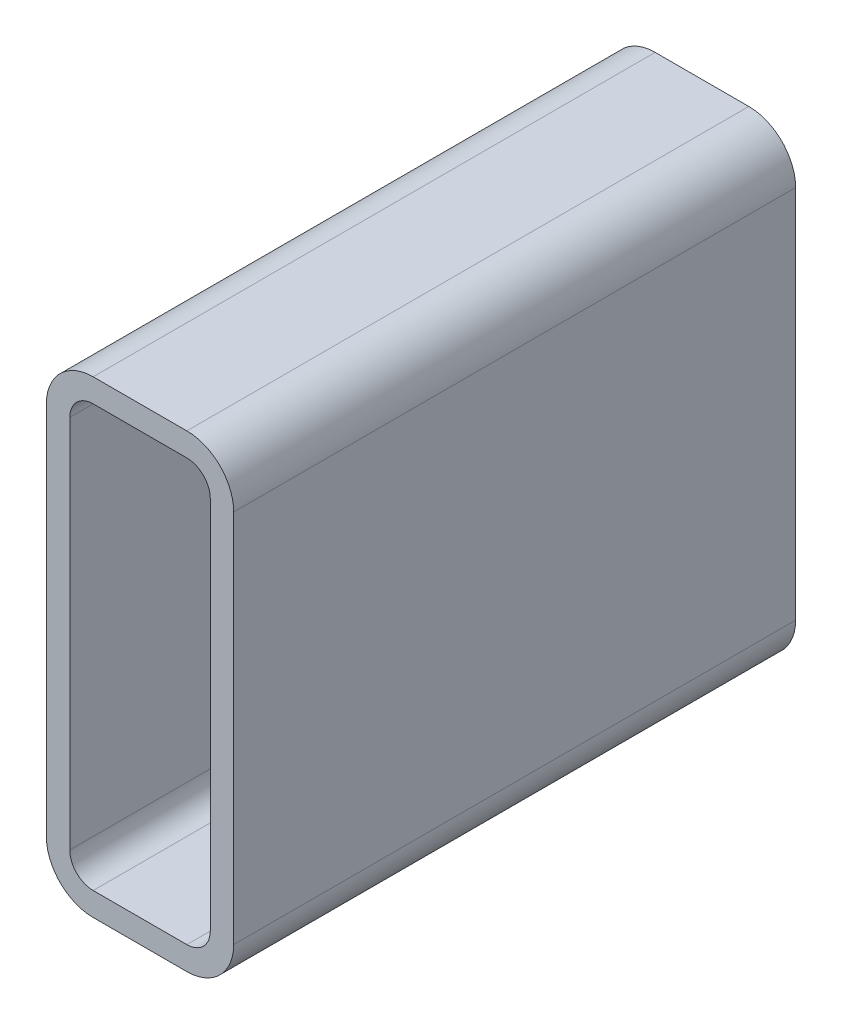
ISO-10303-21;
HEADER;
FILE_DESCRIPTION(('STEP AP214'),'2;1');
FILE_NAME('part.step','',(''),(''),'','','');
FILE_SCHEMA(('AUTOMOTIVE_DESIGN { 1 0 10303 214 1 1 1 1 }'));
ENDSEC;
DATA;
#1=APPLICATION_CONTEXT('core data for automotive mechanical design processes');
#2=APPLICATION_PROTOCOL_DEFINITION('international standard','automotive_design',2000,#1);
#3=PRODUCT_CONTEXT('',#1,'mechanical');
#4=PRODUCT('Part','Part','',(#3));
#5=PRODUCT_RELATED_PRODUCT_CATEGORY('part','',(#4));
#6=PRODUCT_DEFINITION_FORMATION('','',#4);
#7=PRODUCT_DEFINITION_CONTEXT('part definition',#1,'design');
#8=PRODUCT_DEFINITION('design','',#6,#7);
#9=PRODUCT_DEFINITION_SHAPE('','',#8);
#10=(LENGTH_UNIT() NAMED_UNIT(*) SI_UNIT(.MILLI.,.METRE.));
#11=(NAMED_UNIT(*) PLANE_ANGLE_UNIT() SI_UNIT($,.RADIAN.));
#12=(NAMED_UNIT(*) SI_UNIT($,.STERADIAN.) SOLID_ANGLE_UNIT());
#13=UNCERTAINTY_MEASURE_WITH_UNIT(LENGTH_MEASURE(1.E-05),#10,'distance_accuracy_value','');
#14=(GEOMETRIC_REPRESENTATION_CONTEXT(3) GLOBAL_UNCERTAINTY_ASSIGNED_CONTEXT((#13)) GLOBAL_UNIT_ASSIGNED_CONTEXT((#10,
#11,#12)) REPRESENTATION_CONTEXT('',''));
#15=CARTESIAN_POINT('',(0.,0.,0.));
#16=DIRECTION('',(0.,0.,1.));
#17=DIRECTION('',(1.,0.,0.));
#18=AXIS2_PLACEMENT_3D('',#15,#16,#17);
#19=CARTESIAN_POINT('',(27.0751778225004,230.520313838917,304.8));
#20=DIRECTION('',(0.,0.,1.));
#21=DIRECTION('',(1.,0.,0.));
#22=AXIS2_PLACEMENT_3D('',#19,#20,#21);
#23=PLANE('',#22);
#24=CARTESIAN_POINT('',(27.0751778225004,230.520313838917,304.8));
#25=DIRECTION('',(0.,0.,1.));
#26=DIRECTION('',(1.,0.,0.));
#27=AXIS2_PLACEMENT_3D('',#24,#25,#26);
#28=CIRCLE('',#27,25.4);
#29=CARTESIAN_POINT('',(27.0751778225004,255.920313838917,304.8));
#30=VERTEX_POINT('',#29);
#31=CARTESIAN_POINT('',(1.67517782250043,230.520313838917,304.8));
#32=VERTEX_POINT('',#31);
#33=EDGE_CURVE('E211',#30,#32,#28,.T.);
#34=ORIENTED_EDGE('',*,*,#33,.T.);
#35=DIRECTION('',(0.,-1.,0.));
#36=VECTOR('',#35,1.);
#37=CARTESIAN_POINT('',(1.67517782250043,27.3203138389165,304.8));
#38=LINE('',#37,#36);
#39=CARTESIAN_POINT('',(1.67517782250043,27.3203138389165,304.8));
#40=VERTEX_POINT('',#39);
#41=EDGE_CURVE('E214',#32,#40,#38,.T.);
#42=ORIENTED_EDGE('',*,*,#41,.T.);
#43=CARTESIAN_POINT('',(27.0751778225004,27.3203138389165,304.8));
#44=DIRECTION('',(0.,0.,1.));
#45=DIRECTION('',(1.,0.,0.));
#46=AXIS2_PLACEMENT_3D('',#43,#44,#45);
#47=CIRCLE('',#46,25.4);
#48=CARTESIAN_POINT('',(27.0751778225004,1.92031383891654,304.8));
#49=VERTEX_POINT('',#48);
#50=EDGE_CURVE('E217',#40,#49,#47,.T.);
#51=ORIENTED_EDGE('',*,*,#50,.T.);
#52=DIRECTION('',(1.,0.,0.));
#53=VECTOR('',#52,1.);
#54=CARTESIAN_POINT('',(77.8751778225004,1.92031383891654,304.8));
#55=LINE('',#54,#53);
#56=CARTESIAN_POINT('',(77.8751778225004,1.92031383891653,304.8));
#57=VERTEX_POINT('',#56);
#58=EDGE_CURVE('E219',#49,#57,#55,.T.);
#59=ORIENTED_EDGE('',*,*,#58,.T.);
#60=CARTESIAN_POINT('',(77.8751778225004,27.3203138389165,304.8));
#61=DIRECTION('',(0.,0.,1.));
#62=DIRECTION('',(1.,0.,0.));
#63=AXIS2_PLACEMENT_3D('',#60,#61,#62);
#64=CIRCLE('',#63,25.4);
#65=CARTESIAN_POINT('',(103.2751778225,27.3203138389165,304.8));
#66=VERTEX_POINT('',#65);
#67=EDGE_CURVE('E221',#57,#66,#64,.T.);
#68=ORIENTED_EDGE('',*,*,#67,.T.);
#69=DIRECTION('',(0.,1.,0.));
#70=VECTOR('',#69,1.);
#71=CARTESIAN_POINT('',(103.2751778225,230.520313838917,304.8));
#72=LINE('',#71,#70);
#73=CARTESIAN_POINT('',(103.2751778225,230.520313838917,304.8));
#74=VERTEX_POINT('',#73);
#75=EDGE_CURVE('E223',#66,#74,#72,.T.);
#76=ORIENTED_EDGE('',*,*,#75,.T.);
#77=CARTESIAN_POINT('',(77.8751778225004,230.520313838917,304.8));
#78=DIRECTION('',(0.,0.,1.));
#79=DIRECTION('',(1.,0.,0.));
#80=AXIS2_PLACEMENT_3D('',#77,#78,#79);
#81=CIRCLE('',#80,25.4);
#82=CARTESIAN_POINT('',(77.8751778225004,255.920313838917,304.8));
#83=VERTEX_POINT('',#82);
#84=EDGE_CURVE('E225',#74,#83,#81,.T.);
#85=ORIENTED_EDGE('',*,*,#84,.T.);
#86=DIRECTION('',(-1.,0.,0.));
#87=VECTOR('',#86,1.);
#88=CARTESIAN_POINT('',(27.0751778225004,255.920313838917,304.8));
#89=LINE('',#88,#87);
#90=EDGE_CURVE('E227',#83,#30,#89,.T.);
#91=ORIENTED_EDGE('',*,*,#90,.T.);
#92=EDGE_LOOP('',(#34,#42,#51,#59,#68,#76,#85,#91));
#93=FACE_BOUND('',#92,.T.);
#94=DIRECTION('',(0.,-1.,0.));
#95=VECTOR('',#94,1.);
#96=CARTESIAN_POINT('',(14.3751778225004,27.3203138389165,304.8));
#97=LINE('',#96,#95);
#98=CARTESIAN_POINT('',(14.3751778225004,230.520313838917,304.8));
#99=VERTEX_POINT('',#98);
#100=CARTESIAN_POINT('',(14.3751778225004,27.3203138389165,304.8));
#101=VERTEX_POINT('',#100);
#102=EDGE_CURVE('E154',#99,#101,#97,.T.);
#103=ORIENTED_EDGE('',*,*,#102,.F.);
#104=CARTESIAN_POINT('',(27.0751778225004,230.520313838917,304.8));
#105=DIRECTION('',(0.,0.,1.));
#106=DIRECTION('',(1.,0.,0.));
#107=AXIS2_PLACEMENT_3D('',#104,#105,#106);
#108=CIRCLE('',#107,12.7);
#109=CARTESIAN_POINT('',(27.0751778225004,243.220313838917,304.8));
#110=VERTEX_POINT('',#109);
#111=EDGE_CURVE('E146',#110,#99,#108,.T.);
#112=ORIENTED_EDGE('',*,*,#111,.F.);
#113=DIRECTION('',(-1.,0.,0.));
#114=VECTOR('',#113,1.);
#115=CARTESIAN_POINT('',(27.0751778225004,243.220313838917,304.8));
#116=LINE('',#115,#114);
#117=CARTESIAN_POINT('',(77.8751778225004,243.220313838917,304.8));
#118=VERTEX_POINT('',#117);
#119=EDGE_CURVE('E179',#118,#110,#116,.T.);
#120=ORIENTED_EDGE('',*,*,#119,.F.);
#121=CARTESIAN_POINT('',(77.8751778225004,230.520313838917,304.8));
#122=DIRECTION('',(0.,0.,1.));
#123=DIRECTION('',(1.,0.,0.));
#124=AXIS2_PLACEMENT_3D('',#121,#122,#123);
#125=CIRCLE('',#124,12.7);
#126=CARTESIAN_POINT('',(90.5751778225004,230.520313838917,304.8));
#127=VERTEX_POINT('',#126);
#128=EDGE_CURVE('E177',#127,#118,#125,.T.);
#129=ORIENTED_EDGE('',*,*,#128,.F.);
#130=DIRECTION('',(0.,1.,0.));
#131=VECTOR('',#130,1.);
#132=CARTESIAN_POINT('',(90.5751778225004,230.520313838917,304.8));
#133=LINE('',#132,#131);
#134=CARTESIAN_POINT('',(90.5751778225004,27.3203138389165,304.8));
#135=VERTEX_POINT('',#134);
#136=EDGE_CURVE('E175',#135,#127,#133,.T.);
#137=ORIENTED_EDGE('',*,*,#136,.F.);
#138=CARTESIAN_POINT('',(77.8751778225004,27.3203138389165,304.8));
#139=DIRECTION('',(0.,0.,1.));
#140=DIRECTION('',(1.,0.,0.));
#141=AXIS2_PLACEMENT_3D('',#138,#139,#140);
#142=CIRCLE('',#141,12.7);
#143=CARTESIAN_POINT('',(77.8751778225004,14.6203138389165,304.8));
#144=VERTEX_POINT('',#143);
#145=EDGE_CURVE('E173',#144,#135,#142,.T.);
#146=ORIENTED_EDGE('',*,*,#145,.F.);
#147=DIRECTION('',(1.,0.,0.));
#148=VECTOR('',#147,1.);
#149=CARTESIAN_POINT('',(77.8751778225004,14.6203138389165,304.8));
#150=LINE('',#149,#148);
#151=CARTESIAN_POINT('',(27.0751778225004,14.6203138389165,304.8));
#152=VERTEX_POINT('',#151);
#153=EDGE_CURVE('E169',#152,#144,#150,.T.);
#154=ORIENTED_EDGE('',*,*,#153,.F.);
#155=CARTESIAN_POINT('',(27.0751778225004,27.3203138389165,304.8));
#156=DIRECTION('',(0.,0.,1.));
#157=DIRECTION('',(1.,0.,0.));
#158=AXIS2_PLACEMENT_3D('',#155,#156,#157);
#159=CIRCLE('',#158,12.7);
#160=EDGE_CURVE('E167',#101,#152,#159,.T.);
#161=ORIENTED_EDGE('',*,*,#160,.F.);
#162=EDGE_LOOP('',(#103,#112,#120,#129,#137,#146,#154,#161));
#163=FACE_BOUND('',#162,.T.);
#164=ADVANCED_FACE('F33',(#93,#163),#23,.T.);
#165=CARTESIAN_POINT('',(27.0751778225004,230.520313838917,0.));
#166=DIRECTION('',(0.,0.,1.));
#167=DIRECTION('',(1.,0.,0.));
#168=AXIS2_PLACEMENT_3D('',#165,#166,#167);
#169=PLANE('',#168);
#170=CARTESIAN_POINT('',(27.0751778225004,230.520313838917,0.));
#171=DIRECTION('',(0.,0.,1.));
#172=DIRECTION('',(1.,0.,0.));
#173=AXIS2_PLACEMENT_3D('',#170,#171,#172);
#174=CIRCLE('',#173,25.4);
#175=CARTESIAN_POINT('',(27.0751778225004,255.920313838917,0.));
#176=VERTEX_POINT('',#175);
#177=CARTESIAN_POINT('',(1.67517782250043,230.520313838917,0.));
#178=VERTEX_POINT('',#177);
#179=EDGE_CURVE('E162',#176,#178,#174,.T.);
#180=ORIENTED_EDGE('',*,*,#179,.F.);
#181=DIRECTION('',(-1.,0.,0.));
#182=VECTOR('',#181,1.);
#183=CARTESIAN_POINT('',(27.0751778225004,255.920313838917,0.));
#184=LINE('',#183,#182);
#185=CARTESIAN_POINT('',(77.8751778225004,255.920313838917,0.));
#186=VERTEX_POINT('',#185);
#187=EDGE_CURVE('E215',#186,#176,#184,.T.);
#188=ORIENTED_EDGE('',*,*,#187,.F.);
#189=CARTESIAN_POINT('',(77.8751778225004,230.520313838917,0.));
#190=DIRECTION('',(0.,0.,1.));
#191=DIRECTION('',(1.,0.,0.));
#192=AXIS2_PLACEMENT_3D('',#189,#190,#191);
#193=CIRCLE('',#192,25.4);
#194=CARTESIAN_POINT('',(103.2751778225,230.520313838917,0.));
#195=VERTEX_POINT('',#194);
#196=EDGE_CURVE('E242',#195,#186,#193,.T.);
#197=ORIENTED_EDGE('',*,*,#196,.F.);
#198=DIRECTION('',(0.,1.,0.));
#199=VECTOR('',#198,1.);
#200=CARTESIAN_POINT('',(103.2751778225,230.520313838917,0.));
#201=LINE('',#200,#199);
#202=CARTESIAN_POINT('',(103.2751778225,27.3203138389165,0.));
#203=VERTEX_POINT('',#202);
#204=EDGE_CURVE('E240',#203,#195,#201,.T.);
#205=ORIENTED_EDGE('',*,*,#204,.F.);
#206=CARTESIAN_POINT('',(77.8751778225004,27.3203138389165,0.));
#207=DIRECTION('',(0.,0.,1.));
#208=DIRECTION('',(1.,0.,0.));
#209=AXIS2_PLACEMENT_3D('',#206,#207,#208);
#210=CIRCLE('',#209,25.4);
#211=CARTESIAN_POINT('',(77.8751778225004,1.92031383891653,0.));
#212=VERTEX_POINT('',#211);
#213=EDGE_CURVE('E238',#212,#203,#210,.T.);
#214=ORIENTED_EDGE('',*,*,#213,.F.);
#215=DIRECTION('',(1.,0.,0.));
#216=VECTOR('',#215,1.);
#217=CARTESIAN_POINT('',(77.8751778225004,1.92031383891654,0.));
#218=LINE('',#217,#216);
#219=CARTESIAN_POINT('',(27.0751778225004,1.92031383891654,0.));
#220=VERTEX_POINT('',#219);
#221=EDGE_CURVE('E236',#220,#212,#218,.T.);
#222=ORIENTED_EDGE('',*,*,#221,.F.);
#223=CARTESIAN_POINT('',(27.0751778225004,27.3203138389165,0.));
#224=DIRECTION('',(0.,0.,1.));
#225=DIRECTION('',(1.,0.,0.));
#226=AXIS2_PLACEMENT_3D('',#223,#224,#225);
#227=CIRCLE('',#226,25.4);
#228=CARTESIAN_POINT('',(1.67517782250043,27.3203138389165,0.));
#229=VERTEX_POINT('',#228);
#230=EDGE_CURVE('E234',#229,#220,#227,.T.);
#231=ORIENTED_EDGE('',*,*,#230,.F.);
#232=DIRECTION('',(0.,-1.,0.));
#233=VECTOR('',#232,1.);
#234=CARTESIAN_POINT('',(1.67517782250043,27.3203138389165,0.));
#235=LINE('',#234,#233);
#236=EDGE_CURVE('E232',#178,#229,#235,.T.);
#237=ORIENTED_EDGE('',*,*,#236,.F.);
#238=EDGE_LOOP('',(#180,#188,#197,#205,#214,#222,#231,#237));
#239=FACE_BOUND('',#238,.T.);
#240=CARTESIAN_POINT('',(27.0751778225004,230.520313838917,0.));
#241=DIRECTION('',(0.,0.,1.));
#242=DIRECTION('',(1.,0.,0.));
#243=AXIS2_PLACEMENT_3D('',#240,#241,#242);
#244=CIRCLE('',#243,12.7);
#245=CARTESIAN_POINT('',(27.0751778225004,243.220313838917,0.));
#246=VERTEX_POINT('',#245);
#247=CARTESIAN_POINT('',(14.3751778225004,230.520313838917,0.));
#248=VERTEX_POINT('',#247);
#249=EDGE_CURVE('E56',#246,#248,#244,.T.);
#250=ORIENTED_EDGE('',*,*,#249,.T.);
#251=DIRECTION('',(0.,-1.,0.));
#252=VECTOR('',#251,1.);
#253=CARTESIAN_POINT('',(14.3751778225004,27.3203138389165,0.));
#254=LINE('',#253,#252);
#255=CARTESIAN_POINT('',(14.3751778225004,27.3203138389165,0.));
#256=VERTEX_POINT('',#255);
#257=EDGE_CURVE('E161',#248,#256,#254,.T.);
#258=ORIENTED_EDGE('',*,*,#257,.T.);
#259=CARTESIAN_POINT('',(27.0751778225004,27.3203138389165,0.));
#260=DIRECTION('',(0.,0.,1.));
#261=DIRECTION('',(1.,0.,0.));
#262=AXIS2_PLACEMENT_3D('',#259,#260,#261);
#263=CIRCLE('',#262,12.7);
#264=CARTESIAN_POINT('',(27.0751778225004,14.6203138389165,0.));
#265=VERTEX_POINT('',#264);
#266=EDGE_CURVE('E183',#256,#265,#263,.T.);
#267=ORIENTED_EDGE('',*,*,#266,.T.);
#268=DIRECTION('',(1.,0.,0.));
#269=VECTOR('',#268,1.);
#270=CARTESIAN_POINT('',(77.8751778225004,14.6203138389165,0.));
#271=LINE('',#270,#269);
#272=CARTESIAN_POINT('',(77.8751778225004,14.6203138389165,0.));
#273=VERTEX_POINT('',#272);
#274=EDGE_CURVE('E186',#265,#273,#271,.T.);
#275=ORIENTED_EDGE('',*,*,#274,.T.);
#276=CARTESIAN_POINT('',(77.8751778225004,27.3203138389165,0.));
#277=DIRECTION('',(0.,0.,1.));
#278=DIRECTION('',(1.,0.,0.));
#279=AXIS2_PLACEMENT_3D('',#276,#277,#278);
#280=CIRCLE('',#279,12.7);
#281=CARTESIAN_POINT('',(90.5751778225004,27.3203138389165,0.));
#282=VERTEX_POINT('',#281);
#283=EDGE_CURVE('E189',#273,#282,#280,.T.);
#284=ORIENTED_EDGE('',*,*,#283,.T.);
#285=DIRECTION('',(0.,1.,0.));
#286=VECTOR('',#285,1.);
#287=CARTESIAN_POINT('',(90.5751778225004,230.520313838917,0.));
#288=LINE('',#287,#286);
#289=CARTESIAN_POINT('',(90.5751778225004,230.520313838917,0.));
#290=VERTEX_POINT('',#289);
#291=EDGE_CURVE('E192',#282,#290,#288,.T.);
#292=ORIENTED_EDGE('',*,*,#291,.T.);
#293=CARTESIAN_POINT('',(77.8751778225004,230.520313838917,0.));
#294=DIRECTION('',(0.,0.,1.));
#295=DIRECTION('',(1.,0.,0.));
#296=AXIS2_PLACEMENT_3D('',#293,#294,#295);
#297=CIRCLE('',#296,12.7);
#298=CARTESIAN_POINT('',(77.8751778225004,243.220313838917,0.));
#299=VERTEX_POINT('',#298);
#300=EDGE_CURVE('E195',#290,#299,#297,.T.);
#301=ORIENTED_EDGE('',*,*,#300,.T.);
#302=DIRECTION('',(-1.,0.,0.));
#303=VECTOR('',#302,1.);
#304=CARTESIAN_POINT('',(27.0751778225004,243.220313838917,0.));
#305=LINE('',#304,#303);
#306=EDGE_CURVE('E155',#299,#246,#305,.T.);
#307=ORIENTED_EDGE('',*,*,#306,.T.);
#308=EDGE_LOOP('',(#250,#258,#267,#275,#284,#292,#301,#307));
#309=FACE_BOUND('',#308,.T.);
#310=ADVANCED_FACE('F272',(#239,#309),#169,.F.);
#311=CARTESIAN_POINT('',(27.0751778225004,230.520313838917,304.8));
#312=DIRECTION('',(0.,0.,-1.));
#313=DIRECTION('',(-1.,0.,0.));
#314=AXIS2_PLACEMENT_3D('',#311,#312,#313);
#315=CYLINDRICAL_SURFACE('',#314,25.4);
#316=ORIENTED_EDGE('',*,*,#179,.T.);
#317=DIRECTION('',(0.,0.,-1.));
#318=VECTOR('',#317,1.);
#319=CARTESIAN_POINT('',(1.67517782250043,230.520313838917,304.8));
#320=LINE('',#319,#318);
#321=EDGE_CURVE('E11',#32,#178,#320,.T.);
#322=ORIENTED_EDGE('',*,*,#321,.F.);
#323=ORIENTED_EDGE('',*,*,#33,.F.);
#324=DIRECTION('',(0.,0.,-1.));
#325=VECTOR('',#324,1.);
#326=CARTESIAN_POINT('',(27.0751778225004,255.920313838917,304.8));
#327=LINE('',#326,#325);
#328=EDGE_CURVE('E229',#30,#176,#327,.T.);
#329=ORIENTED_EDGE('',*,*,#328,.T.);
#330=EDGE_LOOP('',(#316,#322,#323,#329));
#331=FACE_BOUND('',#330,.T.);
#332=ADVANCED_FACE('F35',(#331),#315,.T.);
#333=CARTESIAN_POINT('',(1.67517782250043,27.3203138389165,304.8));
#334=DIRECTION('',(1.,0.,0.));
#335=DIRECTION('',(0.,0.,-1.));
#336=AXIS2_PLACEMENT_3D('',#333,#334,#335);
#337=PLANE('',#336);
#338=ORIENTED_EDGE('',*,*,#236,.T.);
#339=DIRECTION('',(0.,0.,-1.));
#340=VECTOR('',#339,1.);
#341=CARTESIAN_POINT('',(1.67517782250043,27.3203138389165,304.8));
#342=LINE('',#341,#340);
#343=EDGE_CURVE('E41',#40,#229,#342,.T.);
#344=ORIENTED_EDGE('',*,*,#343,.F.);
#345=ORIENTED_EDGE('',*,*,#41,.F.);
#346=ORIENTED_EDGE('',*,*,#321,.T.);
#347=EDGE_LOOP('',(#338,#344,#345,#346));
#348=FACE_BOUND('',#347,.T.);
#349=ADVANCED_FACE('F289',(#348),#337,.F.);
#350=CARTESIAN_POINT('',(27.0751778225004,27.3203138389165,304.8));
#351=DIRECTION('',(0.,0.,-1.));
#352=DIRECTION('',(-1.,0.,0.));
#353=AXIS2_PLACEMENT_3D('',#350,#351,#352);
#354=CYLINDRICAL_SURFACE('',#353,25.4);
#355=ORIENTED_EDGE('',*,*,#230,.T.);
#356=DIRECTION('',(0.,0.,-1.));
#357=VECTOR('',#356,1.);
#358=CARTESIAN_POINT('',(27.0751778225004,1.92031383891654,304.8));
#359=LINE('',#358,#357);
#360=EDGE_CURVE('E259',#49,#220,#359,.T.);
#361=ORIENTED_EDGE('',*,*,#360,.F.);
#362=ORIENTED_EDGE('',*,*,#50,.F.);
#363=ORIENTED_EDGE('',*,*,#343,.T.);
#364=EDGE_LOOP('',(#355,#361,#362,#363));
#365=FACE_BOUND('',#364,.T.);
#366=ADVANCED_FACE('F266',(#365),#354,.T.);
#367=CARTESIAN_POINT('',(77.8751778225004,1.92031383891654,304.8));
#368=DIRECTION('',(0.,1.,0.));
#369=DIRECTION('',(0.,0.,1.));
#370=AXIS2_PLACEMENT_3D('',#367,#368,#369);
#371=PLANE('',#370);
#372=ORIENTED_EDGE('',*,*,#221,.T.);
#373=DIRECTION('',(0.,0.,-1.));
#374=VECTOR('',#373,1.);
#375=CARTESIAN_POINT('',(77.8751778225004,1.92031383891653,304.8));
#376=LINE('',#375,#374);
#377=EDGE_CURVE('E256',#57,#212,#376,.T.);
#378=ORIENTED_EDGE('',*,*,#377,.F.);
#379=ORIENTED_EDGE('',*,*,#58,.F.);
#380=ORIENTED_EDGE('',*,*,#360,.T.);
#381=EDGE_LOOP('',(#372,#378,#379,#380));
#382=FACE_BOUND('',#381,.T.);
#383=ADVANCED_FACE('F278',(#382),#371,.F.);
#384=CARTESIAN_POINT('',(77.8751778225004,27.3203138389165,304.8));
#385=DIRECTION('',(0.,0.,-1.));
#386=DIRECTION('',(-1.,0.,0.));
#387=AXIS2_PLACEMENT_3D('',#384,#385,#386);
#388=CYLINDRICAL_SURFACE('',#387,25.4);
#389=ORIENTED_EDGE('',*,*,#213,.T.);
#390=DIRECTION('',(0.,0.,-1.));
#391=VECTOR('',#390,1.);
#392=CARTESIAN_POINT('',(103.2751778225,27.3203138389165,304.8));
#393=LINE('',#392,#391);
#394=EDGE_CURVE('E253',#66,#203,#393,.T.);
#395=ORIENTED_EDGE('',*,*,#394,.F.);
#396=ORIENTED_EDGE('',*,*,#67,.F.);
#397=ORIENTED_EDGE('',*,*,#377,.T.);
#398=EDGE_LOOP('',(#389,#395,#396,#397));
#399=FACE_BOUND('',#398,.T.);
#400=ADVANCED_FACE('F282',(#399),#388,.T.);
#401=CARTESIAN_POINT('',(103.2751778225,230.520313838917,304.8));
#402=DIRECTION('',(-1.,0.,0.));
#403=DIRECTION('',(0.,0.,1.));
#404=AXIS2_PLACEMENT_3D('',#401,#402,#403);
#405=PLANE('',#404);
#406=ORIENTED_EDGE('',*,*,#204,.T.);
#407=DIRECTION('',(0.,0.,-1.));
#408=VECTOR('',#407,1.);
#409=CARTESIAN_POINT('',(103.2751778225,230.520313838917,304.8));
#410=LINE('',#409,#408);
#411=EDGE_CURVE('E250',#74,#195,#410,.T.);
#412=ORIENTED_EDGE('',*,*,#411,.F.);
#413=ORIENTED_EDGE('',*,*,#75,.F.);
#414=ORIENTED_EDGE('',*,*,#394,.T.);
#415=EDGE_LOOP('',(#406,#412,#413,#414));
#416=FACE_BOUND('',#415,.T.);
#417=ADVANCED_FACE('F302',(#416),#405,.F.);
#418=CARTESIAN_POINT('',(77.8751778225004,230.520313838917,304.8));
#419=DIRECTION('',(0.,0.,-1.));
#420=DIRECTION('',(-1.,0.,0.));
#421=AXIS2_PLACEMENT_3D('',#418,#419,#420);
#422=CYLINDRICAL_SURFACE('',#421,25.4);
#423=ORIENTED_EDGE('',*,*,#196,.T.);
#424=DIRECTION('',(0.,0.,-1.));
#425=VECTOR('',#424,1.);
#426=CARTESIAN_POINT('',(77.8751778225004,255.920313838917,304.8));
#427=LINE('',#426,#425);
#428=EDGE_CURVE('E247',#83,#186,#427,.T.);
#429=ORIENTED_EDGE('',*,*,#428,.F.);
#430=ORIENTED_EDGE('',*,*,#84,.F.);
#431=ORIENTED_EDGE('',*,*,#411,.T.);
#432=EDGE_LOOP('',(#423,#429,#430,#431));
#433=FACE_BOUND('',#432,.T.);
#434=ADVANCED_FACE('F300',(#433),#422,.T.);
#435=CARTESIAN_POINT('',(27.0751778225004,255.920313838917,304.8));
#436=DIRECTION('',(0.,-1.,0.));
#437=DIRECTION('',(0.,0.,-1.));
#438=AXIS2_PLACEMENT_3D('',#435,#436,#437);
#439=PLANE('',#438);
#440=ORIENTED_EDGE('',*,*,#187,.T.);
#441=ORIENTED_EDGE('',*,*,#328,.F.);
#442=ORIENTED_EDGE('',*,*,#90,.F.);
#443=ORIENTED_EDGE('',*,*,#428,.T.);
#444=EDGE_LOOP('',(#440,#441,#442,#443));
#445=FACE_BOUND('',#444,.T.);
#446=ADVANCED_FACE('F295',(#445),#439,.F.);
#447=CARTESIAN_POINT('',(27.0751778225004,230.520313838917,304.8));
#448=DIRECTION('',(0.,0.,-1.));
#449=DIRECTION('',(-1.,0.,0.));
#450=AXIS2_PLACEMENT_3D('',#447,#448,#449);
#451=CYLINDRICAL_SURFACE('',#450,12.7);
#452=ORIENTED_EDGE('',*,*,#249,.F.);
#453=DIRECTION('',(0.,0.,-1.));
#454=VECTOR('',#453,1.);
#455=CARTESIAN_POINT('',(27.0751778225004,243.220313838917,304.8));
#456=LINE('',#455,#454);
#457=EDGE_CURVE('E150',#110,#246,#456,.T.);
#458=ORIENTED_EDGE('',*,*,#457,.F.);
#459=ORIENTED_EDGE('',*,*,#111,.T.);
#460=DIRECTION('',(0.,0.,-1.));
#461=VECTOR('',#460,1.);
#462=CARTESIAN_POINT('',(14.3751778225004,230.520313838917,304.8));
#463=LINE('',#462,#461);
#464=EDGE_CURVE('E149',#99,#248,#463,.T.);
#465=ORIENTED_EDGE('',*,*,#464,.T.);
#466=EDGE_LOOP('',(#452,#458,#459,#465));
#467=FACE_BOUND('',#466,.T.);
#468=ADVANCED_FACE('F148',(#467),#451,.F.);
#469=CARTESIAN_POINT('',(14.3751778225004,27.3203138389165,304.8));
#470=DIRECTION('',(1.,0.,0.));
#471=DIRECTION('',(0.,0.,-1.));
#472=AXIS2_PLACEMENT_3D('',#469,#470,#471);
#473=PLANE('',#472);
#474=ORIENTED_EDGE('',*,*,#257,.F.);
#475=ORIENTED_EDGE('',*,*,#464,.F.);
#476=ORIENTED_EDGE('',*,*,#102,.T.);
#477=DIRECTION('',(0.,0.,-1.));
#478=VECTOR('',#477,1.);
#479=CARTESIAN_POINT('',(14.3751778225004,27.3203138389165,304.8));
#480=LINE('',#479,#478);
#481=EDGE_CURVE('E163',#101,#256,#480,.T.);
#482=ORIENTED_EDGE('',*,*,#481,.T.);
#483=EDGE_LOOP('',(#474,#475,#476,#482));
#484=FACE_BOUND('',#483,.T.);
#485=ADVANCED_FACE('F158',(#484),#473,.T.);
#486=CARTESIAN_POINT('',(27.0751778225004,27.3203138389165,304.8));
#487=DIRECTION('',(0.,0.,-1.));
#488=DIRECTION('',(-1.,0.,0.));
#489=AXIS2_PLACEMENT_3D('',#486,#487,#488);
#490=CYLINDRICAL_SURFACE('',#489,12.7);
#491=ORIENTED_EDGE('',*,*,#266,.F.);
#492=ORIENTED_EDGE('',*,*,#481,.F.);
#493=ORIENTED_EDGE('',*,*,#160,.T.);
#494=DIRECTION('',(0.,0.,-1.));
#495=VECTOR('',#494,1.);
#496=CARTESIAN_POINT('',(27.0751778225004,14.6203138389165,304.8));
#497=LINE('',#496,#495);
#498=EDGE_CURVE('E208',#152,#265,#497,.T.);
#499=ORIENTED_EDGE('',*,*,#498,.T.);
#500=EDGE_LOOP('',(#491,#492,#493,#499));
#501=FACE_BOUND('',#500,.T.);
#502=ADVANCED_FACE('F327',(#501),#490,.F.);
#503=CARTESIAN_POINT('',(77.8751778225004,14.6203138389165,304.8));
#504=DIRECTION('',(0.,1.,0.));
#505=DIRECTION('',(0.,0.,1.));
#506=AXIS2_PLACEMENT_3D('',#503,#504,#505);
#507=PLANE('',#506);
#508=ORIENTED_EDGE('',*,*,#274,.F.);
#509=ORIENTED_EDGE('',*,*,#498,.F.);
#510=ORIENTED_EDGE('',*,*,#153,.T.);
#511=DIRECTION('',(0.,0.,-1.));
#512=VECTOR('',#511,1.);
#513=CARTESIAN_POINT('',(77.8751778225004,14.6203138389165,304.8));
#514=LINE('',#513,#512);
#515=EDGE_CURVE('E206',#144,#273,#514,.T.);
#516=ORIENTED_EDGE('',*,*,#515,.T.);
#517=EDGE_LOOP('',(#508,#509,#510,#516));
#518=FACE_BOUND('',#517,.T.);
#519=ADVANCED_FACE('F331',(#518),#507,.T.);
#520=CARTESIAN_POINT('',(77.8751778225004,27.3203138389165,304.8));
#521=DIRECTION('',(0.,0.,-1.));
#522=DIRECTION('',(-1.,0.,0.));
#523=AXIS2_PLACEMENT_3D('',#520,#521,#522);
#524=CYLINDRICAL_SURFACE('',#523,12.7);
#525=ORIENTED_EDGE('',*,*,#283,.F.);
#526=ORIENTED_EDGE('',*,*,#515,.F.);
#527=ORIENTED_EDGE('',*,*,#145,.T.);
#528=DIRECTION('',(0.,0.,-1.));
#529=VECTOR('',#528,1.);
#530=CARTESIAN_POINT('',(90.5751778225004,27.3203138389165,304.8));
#531=LINE('',#530,#529);
#532=EDGE_CURVE('E204',#135,#282,#531,.T.);
#533=ORIENTED_EDGE('',*,*,#532,.T.);
#534=EDGE_LOOP('',(#525,#526,#527,#533));
#535=FACE_BOUND('',#534,.T.);
#536=ADVANCED_FACE('F337',(#535),#524,.F.);
#537=CARTESIAN_POINT('',(90.5751778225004,230.520313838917,304.8));
#538=DIRECTION('',(-1.,0.,0.));
#539=DIRECTION('',(0.,0.,1.));
#540=AXIS2_PLACEMENT_3D('',#537,#538,#539);
#541=PLANE('',#540);
#542=ORIENTED_EDGE('',*,*,#291,.F.);
#543=ORIENTED_EDGE('',*,*,#532,.F.);
#544=ORIENTED_EDGE('',*,*,#136,.T.);
#545=DIRECTION('',(0.,0.,-1.));
#546=VECTOR('',#545,1.);
#547=CARTESIAN_POINT('',(90.5751778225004,230.520313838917,304.8));
#548=LINE('',#547,#546);
#549=EDGE_CURVE('E202',#127,#290,#548,.T.);
#550=ORIENTED_EDGE('',*,*,#549,.T.);
#551=EDGE_LOOP('',(#542,#543,#544,#550));
#552=FACE_BOUND('',#551,.T.);
#553=ADVANCED_FACE('F341',(#552),#541,.T.);
#554=CARTESIAN_POINT('',(77.8751778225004,230.520313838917,304.8));
#555=DIRECTION('',(0.,0.,-1.));
#556=DIRECTION('',(-1.,0.,0.));
#557=AXIS2_PLACEMENT_3D('',#554,#555,#556);
#558=CYLINDRICAL_SURFACE('',#557,12.7);
#559=ORIENTED_EDGE('',*,*,#300,.F.);
#560=ORIENTED_EDGE('',*,*,#549,.F.);
#561=ORIENTED_EDGE('',*,*,#128,.T.);
#562=DIRECTION('',(0.,0.,-1.));
#563=VECTOR('',#562,1.);
#564=CARTESIAN_POINT('',(77.8751778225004,243.220313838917,304.8));
#565=LINE('',#564,#563);
#566=EDGE_CURVE('E48',#118,#299,#565,.T.);
#567=ORIENTED_EDGE('',*,*,#566,.T.);
#568=EDGE_LOOP('',(#559,#560,#561,#567));
#569=FACE_BOUND('',#568,.T.);
#570=ADVANCED_FACE('F345',(#569),#558,.F.);
#571=CARTESIAN_POINT('',(27.0751778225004,243.220313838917,304.8));
#572=DIRECTION('',(0.,-1.,0.));
#573=DIRECTION('',(0.,0.,-1.));
#574=AXIS2_PLACEMENT_3D('',#571,#572,#573);
#575=PLANE('',#574);
#576=ORIENTED_EDGE('',*,*,#306,.F.);
#577=ORIENTED_EDGE('',*,*,#566,.F.);
#578=ORIENTED_EDGE('',*,*,#119,.T.);
#579=ORIENTED_EDGE('',*,*,#457,.T.);
#580=EDGE_LOOP('',(#576,#577,#578,#579));
#581=FACE_BOUND('',#580,.T.);
#582=ADVANCED_FACE('F349',(#581),#575,.T.);
#583=CLOSED_SHELL('',(#164,#310,#332,#349,#366,#383,#400,#417,#434,#446,#468,#485,#502,#519,
#536,#553,#570,#582));
#584=MANIFOLD_SOLID_BREP('B2',#583);
#585=ADVANCED_BREP_SHAPE_REPRESENTATION('',(#18,#584),#14);
#586=SHAPE_DEFINITION_REPRESENTATION(#9,#585);
ENDSEC;
END-ISO-10303-21;
